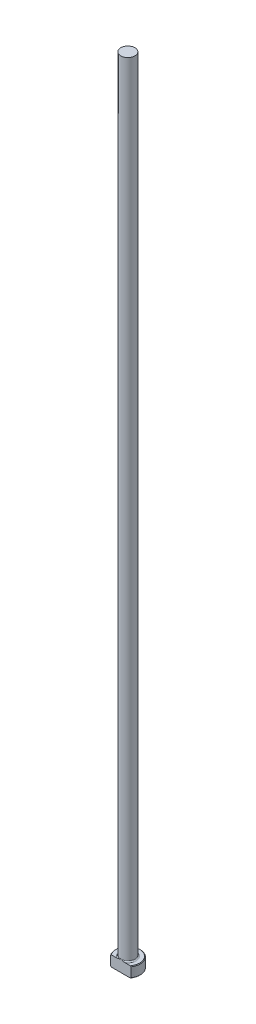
from build123d import *

# Parameters (mm, degrees)
CHAMFER1_SIZE = 0.254
FILLET1_R     = 0.508
KEY_DEPTH     = 356.686607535


with BuildPart() as part:
    # Sketch1 → Revolve1 (revolve)
    with BuildSketch(Plane.XY, mode=Mode.PRIVATE) as revolve1_sk:
        Polygon((0, 0), (-5.5499, 0), (-5.5499, 4.7498), (-3.175, 4.7498), (-3.175, 355.6), (0, 355.6), align=None)
    revolve(revolve1_sk.sketch.rotate(Axis((0, 259.958771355, 0), (0, -1, 0)), 270), axis=Axis((0, 259.958771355, 0), (0, -1, 0)))

    # Chamfer1
    chamfer1_edges = [part.edges().sort_by_distance(p)[0] for p in [
        (0, 4.7498, -5.5499),
        (0, 0, -5.5499),
    ]]
    chamfer(chamfer1_edges, length=CHAMFER1_SIZE)

    # Fillet1
    fillet1_edges = [part.edges().sort_by_distance(p)[0] for p in [
        (0, 4.7498, -3.175),
    ]]
    fillet(fillet1_edges, radius=FILLET1_R)

    # Sketch2 → Key (cut, through all)
    with BuildSketch(Plane(origin=(0, 0, 0), x_dir=(1, 0, 0), z_dir=(0, 1, 0))):
        with BuildLine():
            Line((-4.552006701, -3.175), (4.552006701, -3.175))
            ThreePointArc((4.552006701, -3.175), (0, -5.5499), (-4.552006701, -3.175))
        make_face()
    extrude(amount=KEY_DEPTH, mode=Mode.SUBTRACT)


solid = part.part
